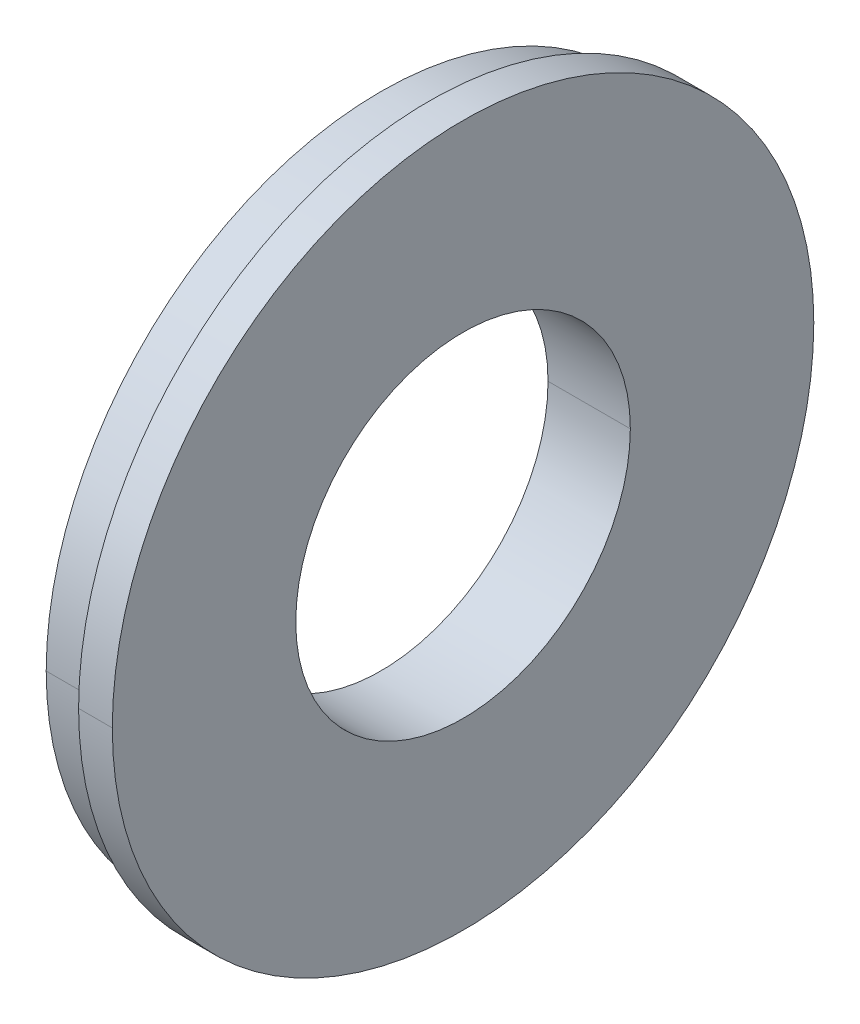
ISO-10303-21;
HEADER;
FILE_DESCRIPTION(('STEP AP214'),'2;1');
FILE_NAME('part.step','',(''),(''),'','','');
FILE_SCHEMA(('AUTOMOTIVE_DESIGN { 1 0 10303 214 1 1 1 1 }'));
ENDSEC;
DATA;
#1=APPLICATION_CONTEXT('core data for automotive mechanical design processes');
#2=APPLICATION_PROTOCOL_DEFINITION('international standard','automotive_design',2000,#1);
#3=PRODUCT_CONTEXT('',#1,'mechanical');
#4=PRODUCT('Part','Part','',(#3));
#5=PRODUCT_RELATED_PRODUCT_CATEGORY('part','',(#4));
#6=PRODUCT_DEFINITION_FORMATION('','',#4);
#7=PRODUCT_DEFINITION_CONTEXT('part definition',#1,'design');
#8=PRODUCT_DEFINITION('design','',#6,#7);
#9=PRODUCT_DEFINITION_SHAPE('','',#8);
#10=(LENGTH_UNIT() NAMED_UNIT(*) SI_UNIT(.MILLI.,.METRE.));
#11=(NAMED_UNIT(*) PLANE_ANGLE_UNIT() SI_UNIT($,.RADIAN.));
#12=(NAMED_UNIT(*) SI_UNIT($,.STERADIAN.) SOLID_ANGLE_UNIT());
#13=UNCERTAINTY_MEASURE_WITH_UNIT(LENGTH_MEASURE(1.E-05),#10,'distance_accuracy_value','');
#14=(GEOMETRIC_REPRESENTATION_CONTEXT(3) GLOBAL_UNCERTAINTY_ASSIGNED_CONTEXT((#13)) GLOBAL_UNIT_ASSIGNED_CONTEXT((#10,
#11,#12)) REPRESENTATION_CONTEXT('',''));
#15=CARTESIAN_POINT('',(0.,0.,0.));
#16=DIRECTION('',(0.,0.,1.));
#17=DIRECTION('',(1.,0.,0.));
#18=AXIS2_PLACEMENT_3D('',#15,#16,#17);
#19=CARTESIAN_POINT('',(28.775,0.,0.));
#20=DIRECTION('',(1.,0.,0.));
#21=DIRECTION('',(0.,0.,1.));
#22=AXIS2_PLACEMENT_3D('',#19,#20,#21);
#23=CYLINDRICAL_SURFACE('',#22,6.2);
#24=DIRECTION('',(1.,0.,0.));
#25=VECTOR('',#24,1.);
#26=CARTESIAN_POINT('',(28.775,0.,6.2));
#27=LINE('',#26,#25);
#28=CARTESIAN_POINT('',(27.25,0.,6.2));
#29=VERTEX_POINT('',#28);
#30=CARTESIAN_POINT('',(30.3,0.,6.2));
#31=VERTEX_POINT('',#30);
#32=EDGE_CURVE('E119',#29,#31,#27,.T.);
#33=ORIENTED_EDGE('',*,*,#32,.F.);
#34=CARTESIAN_POINT('',(27.25,0.,0.));
#35=DIRECTION('',(1.,0.,0.));
#36=DIRECTION('',(0.,0.,1.));
#37=AXIS2_PLACEMENT_3D('',#34,#35,#36);
#38=CIRCLE('',#37,6.2);
#39=CARTESIAN_POINT('',(27.25,0.,-6.2));
#40=VERTEX_POINT('',#39);
#41=EDGE_CURVE('E38',#40,#29,#38,.T.);
#42=ORIENTED_EDGE('',*,*,#41,.F.);
#43=DIRECTION('',(-1.,0.,0.));
#44=VECTOR('',#43,1.);
#45=CARTESIAN_POINT('',(28.775,0.,-6.2));
#46=LINE('',#45,#44);
#47=CARTESIAN_POINT('',(30.3,0.,-6.2));
#48=VERTEX_POINT('',#47);
#49=EDGE_CURVE('E103',#48,#40,#46,.T.);
#50=ORIENTED_EDGE('',*,*,#49,.F.);
#51=CARTESIAN_POINT('',(30.3,0.,0.));
#52=DIRECTION('',(1.,0.,0.));
#53=DIRECTION('',(0.,0.,1.));
#54=AXIS2_PLACEMENT_3D('',#51,#52,#53);
#55=CIRCLE('',#54,6.2);
#56=EDGE_CURVE('E11',#48,#31,#55,.T.);
#57=ORIENTED_EDGE('',*,*,#56,.T.);
#58=EDGE_LOOP('',(#33,#42,#50,#57));
#59=FACE_BOUND('',#58,.T.);
#60=ADVANCED_FACE('F16',(#59),#23,.F.);
#61=CARTESIAN_POINT('',(29.675,0.,0.));
#62=DIRECTION('',(1.,0.,0.));
#63=DIRECTION('',(0.,0.,1.));
#64=AXIS2_PLACEMENT_3D('',#61,#62,#63);
#65=CYLINDRICAL_SURFACE('',#64,13.);
#66=DIRECTION('',(1.,0.,0.));
#67=VECTOR('',#66,1.);
#68=CARTESIAN_POINT('',(29.675,0.,13.));
#69=LINE('',#68,#67);
#70=CARTESIAN_POINT('',(29.05,0.,13.));
#71=VERTEX_POINT('',#70);
#72=CARTESIAN_POINT('',(30.3,0.,13.));
#73=VERTEX_POINT('',#72);
#74=EDGE_CURVE('E93',#71,#73,#69,.T.);
#75=ORIENTED_EDGE('',*,*,#74,.F.);
#76=CARTESIAN_POINT('',(29.05,0.,0.));
#77=DIRECTION('',(1.,0.,0.));
#78=DIRECTION('',(0.,0.,1.));
#79=AXIS2_PLACEMENT_3D('',#76,#77,#78);
#80=CIRCLE('',#79,13.);
#81=CARTESIAN_POINT('',(29.05,0.,-13.));
#82=VERTEX_POINT('',#81);
#83=EDGE_CURVE('E26',#71,#82,#80,.T.);
#84=ORIENTED_EDGE('',*,*,#83,.T.);
#85=DIRECTION('',(-1.,0.,0.));
#86=VECTOR('',#85,1.);
#87=CARTESIAN_POINT('',(29.675,0.,-13.));
#88=LINE('',#87,#86);
#89=CARTESIAN_POINT('',(30.3,0.,-13.));
#90=VERTEX_POINT('',#89);
#91=EDGE_CURVE('E100',#90,#82,#88,.T.);
#92=ORIENTED_EDGE('',*,*,#91,.F.);
#93=CARTESIAN_POINT('',(30.3,0.,0.));
#94=DIRECTION('',(1.,0.,0.));
#95=DIRECTION('',(0.,0.,1.));
#96=AXIS2_PLACEMENT_3D('',#93,#94,#95);
#97=CIRCLE('',#96,13.);
#98=EDGE_CURVE('E111',#73,#90,#97,.T.);
#99=ORIENTED_EDGE('',*,*,#98,.F.);
#100=EDGE_LOOP('',(#75,#84,#92,#99));
#101=FACE_BOUND('',#100,.T.);
#102=ADVANCED_FACE('F18',(#101),#65,.T.);
#103=CARTESIAN_POINT('',(28.15,0.,0.));
#104=DIRECTION('',(1.,0.,0.));
#105=DIRECTION('',(0.,0.,1.));
#106=AXIS2_PLACEMENT_3D('',#103,#104,#105);
#107=CYLINDRICAL_SURFACE('',#106,12.4);
#108=DIRECTION('',(1.,0.,0.));
#109=VECTOR('',#108,1.);
#110=CARTESIAN_POINT('',(28.15,0.,12.4));
#111=LINE('',#110,#109);
#112=CARTESIAN_POINT('',(27.25,0.,12.4));
#113=VERTEX_POINT('',#112);
#114=CARTESIAN_POINT('',(29.05,0.,12.4));
#115=VERTEX_POINT('',#114);
#116=EDGE_CURVE('E73',#113,#115,#111,.T.);
#117=ORIENTED_EDGE('',*,*,#116,.F.);
#118=CARTESIAN_POINT('',(27.25,0.,0.));
#119=DIRECTION('',(1.,0.,0.));
#120=DIRECTION('',(0.,0.,1.));
#121=AXIS2_PLACEMENT_3D('',#118,#119,#120);
#122=CIRCLE('',#121,12.4);
#123=CARTESIAN_POINT('',(27.25,0.,-12.4));
#124=VERTEX_POINT('',#123);
#125=EDGE_CURVE('E89',#113,#124,#122,.T.);
#126=ORIENTED_EDGE('',*,*,#125,.T.);
#127=DIRECTION('',(-1.,0.,0.));
#128=VECTOR('',#127,1.);
#129=CARTESIAN_POINT('',(28.15,0.,-12.4));
#130=LINE('',#129,#128);
#131=CARTESIAN_POINT('',(29.05,0.,-12.4));
#132=VERTEX_POINT('',#131);
#133=EDGE_CURVE('E76',#132,#124,#130,.T.);
#134=ORIENTED_EDGE('',*,*,#133,.F.);
#135=CARTESIAN_POINT('',(29.05,0.,0.));
#136=DIRECTION('',(1.,0.,0.));
#137=DIRECTION('',(0.,0.,1.));
#138=AXIS2_PLACEMENT_3D('',#135,#136,#137);
#139=CIRCLE('',#138,12.4);
#140=EDGE_CURVE('E68',#115,#132,#139,.T.);
#141=ORIENTED_EDGE('',*,*,#140,.F.);
#142=EDGE_LOOP('',(#117,#126,#134,#141));
#143=FACE_BOUND('',#142,.T.);
#144=ADVANCED_FACE('F70',(#143),#107,.T.);
#145=CARTESIAN_POINT('',(28.15,0.,0.));
#146=DIRECTION('',(1.,0.,0.));
#147=DIRECTION('',(0.,0.,1.));
#148=AXIS2_PLACEMENT_3D('',#145,#146,#147);
#149=CYLINDRICAL_SURFACE('',#148,12.4);
#150=ORIENTED_EDGE('',*,*,#116,.T.);
#151=CARTESIAN_POINT('',(29.05,0.,0.));
#152=DIRECTION('',(1.,0.,0.));
#153=DIRECTION('',(0.,0.,1.));
#154=AXIS2_PLACEMENT_3D('',#151,#152,#153);
#155=CIRCLE('',#154,12.4);
#156=EDGE_CURVE('E82',#132,#115,#155,.T.);
#157=ORIENTED_EDGE('',*,*,#156,.F.);
#158=ORIENTED_EDGE('',*,*,#133,.T.);
#159=CARTESIAN_POINT('',(27.25,0.,0.));
#160=DIRECTION('',(1.,0.,0.));
#161=DIRECTION('',(0.,0.,1.));
#162=AXIS2_PLACEMENT_3D('',#159,#160,#161);
#163=CIRCLE('',#162,12.4);
#164=EDGE_CURVE('E81',#124,#113,#163,.T.);
#165=ORIENTED_EDGE('',*,*,#164,.T.);
#166=EDGE_LOOP('',(#150,#157,#158,#165));
#167=FACE_BOUND('',#166,.T.);
#168=ADVANCED_FACE('F86',(#167),#149,.T.);
#169=CARTESIAN_POINT('',(29.05,0.,12.7));
#170=DIRECTION('',(-1.,0.,0.));
#171=DIRECTION('',(0.,0.,1.));
#172=AXIS2_PLACEMENT_3D('',#169,#170,#171);
#173=PLANE('',#172);
#174=ORIENTED_EDGE('',*,*,#83,.F.);
#175=CARTESIAN_POINT('',(29.05,0.,0.));
#176=DIRECTION('',(1.,0.,0.));
#177=DIRECTION('',(0.,0.,1.));
#178=AXIS2_PLACEMENT_3D('',#175,#176,#177);
#179=CIRCLE('',#178,13.);
#180=EDGE_CURVE('E110',#82,#71,#179,.T.);
#181=ORIENTED_EDGE('',*,*,#180,.F.);
#182=EDGE_LOOP('',(#174,#181));
#183=FACE_BOUND('',#182,.T.);
#184=ORIENTED_EDGE('',*,*,#140,.T.);
#185=ORIENTED_EDGE('',*,*,#156,.T.);
#186=EDGE_LOOP('',(#184,#185));
#187=FACE_BOUND('',#186,.T.);
#188=ADVANCED_FACE('F91',(#183,#187),#173,.T.);
#189=CARTESIAN_POINT('',(29.675,0.,0.));
#190=DIRECTION('',(1.,0.,0.));
#191=DIRECTION('',(0.,0.,1.));
#192=AXIS2_PLACEMENT_3D('',#189,#190,#191);
#193=CYLINDRICAL_SURFACE('',#192,13.);
#194=ORIENTED_EDGE('',*,*,#74,.T.);
#195=CARTESIAN_POINT('',(30.3,0.,0.));
#196=DIRECTION('',(1.,0.,0.));
#197=DIRECTION('',(0.,0.,1.));
#198=AXIS2_PLACEMENT_3D('',#195,#196,#197);
#199=CIRCLE('',#198,13.);
#200=EDGE_CURVE('E114',#90,#73,#199,.T.);
#201=ORIENTED_EDGE('',*,*,#200,.F.);
#202=ORIENTED_EDGE('',*,*,#91,.T.);
#203=ORIENTED_EDGE('',*,*,#180,.T.);
#204=EDGE_LOOP('',(#194,#201,#202,#203));
#205=FACE_BOUND('',#204,.T.);
#206=ADVANCED_FACE('F146',(#205),#193,.T.);
#207=CARTESIAN_POINT('',(30.3,0.,9.6));
#208=DIRECTION('',(1.,0.,0.));
#209=DIRECTION('',(0.,1.,0.));
#210=AXIS2_PLACEMENT_3D('',#207,#208,#209);
#211=PLANE('',#210);
#212=ORIENTED_EDGE('',*,*,#98,.T.);
#213=ORIENTED_EDGE('',*,*,#200,.T.);
#214=EDGE_LOOP('',(#212,#213));
#215=FACE_BOUND('',#214,.T.);
#216=CARTESIAN_POINT('',(30.3,0.,0.));
#217=DIRECTION('',(1.,0.,0.));
#218=DIRECTION('',(0.,0.,1.));
#219=AXIS2_PLACEMENT_3D('',#216,#217,#218);
#220=CIRCLE('',#219,6.2);
#221=EDGE_CURVE('E121',#31,#48,#220,.T.);
#222=ORIENTED_EDGE('',*,*,#221,.F.);
#223=ORIENTED_EDGE('',*,*,#56,.F.);
#224=EDGE_LOOP('',(#222,#223));
#225=FACE_BOUND('',#224,.T.);
#226=ADVANCED_FACE('F139',(#215,#225),#211,.T.);
#227=CARTESIAN_POINT('',(28.775,0.,0.));
#228=DIRECTION('',(1.,0.,0.));
#229=DIRECTION('',(0.,0.,1.));
#230=AXIS2_PLACEMENT_3D('',#227,#228,#229);
#231=CYLINDRICAL_SURFACE('',#230,6.2);
#232=ORIENTED_EDGE('',*,*,#32,.T.);
#233=ORIENTED_EDGE('',*,*,#221,.T.);
#234=ORIENTED_EDGE('',*,*,#49,.T.);
#235=CARTESIAN_POINT('',(27.25,0.,0.));
#236=DIRECTION('',(1.,0.,0.));
#237=DIRECTION('',(0.,0.,1.));
#238=AXIS2_PLACEMENT_3D('',#235,#236,#237);
#239=CIRCLE('',#238,6.2);
#240=EDGE_CURVE('E20',#29,#40,#239,.T.);
#241=ORIENTED_EDGE('',*,*,#240,.F.);
#242=EDGE_LOOP('',(#232,#233,#234,#241));
#243=FACE_BOUND('',#242,.T.);
#244=ADVANCED_FACE('F163',(#243),#231,.F.);
#245=CARTESIAN_POINT('',(27.25,0.,9.3));
#246=DIRECTION('',(-1.,0.,0.));
#247=DIRECTION('',(0.,0.,1.));
#248=AXIS2_PLACEMENT_3D('',#245,#246,#247);
#249=PLANE('',#248);
#250=ORIENTED_EDGE('',*,*,#125,.F.);
#251=ORIENTED_EDGE('',*,*,#164,.F.);
#252=EDGE_LOOP('',(#250,#251));
#253=FACE_BOUND('',#252,.T.);
#254=ORIENTED_EDGE('',*,*,#240,.T.);
#255=ORIENTED_EDGE('',*,*,#41,.T.);
#256=EDGE_LOOP('',(#254,#255));
#257=FACE_BOUND('',#256,.T.);
#258=ADVANCED_FACE('F161',(#253,#257),#249,.T.);
#259=CLOSED_SHELL('',(#60,#102,#144,#168,#188,#206,#226,#244,#258));
#260=MANIFOLD_SOLID_BREP('B1',#259);
#261=ADVANCED_BREP_SHAPE_REPRESENTATION('',(#18,#260),#14);
#262=SHAPE_DEFINITION_REPRESENTATION(#9,#261);
ENDSEC;
END-ISO-10303-21;
